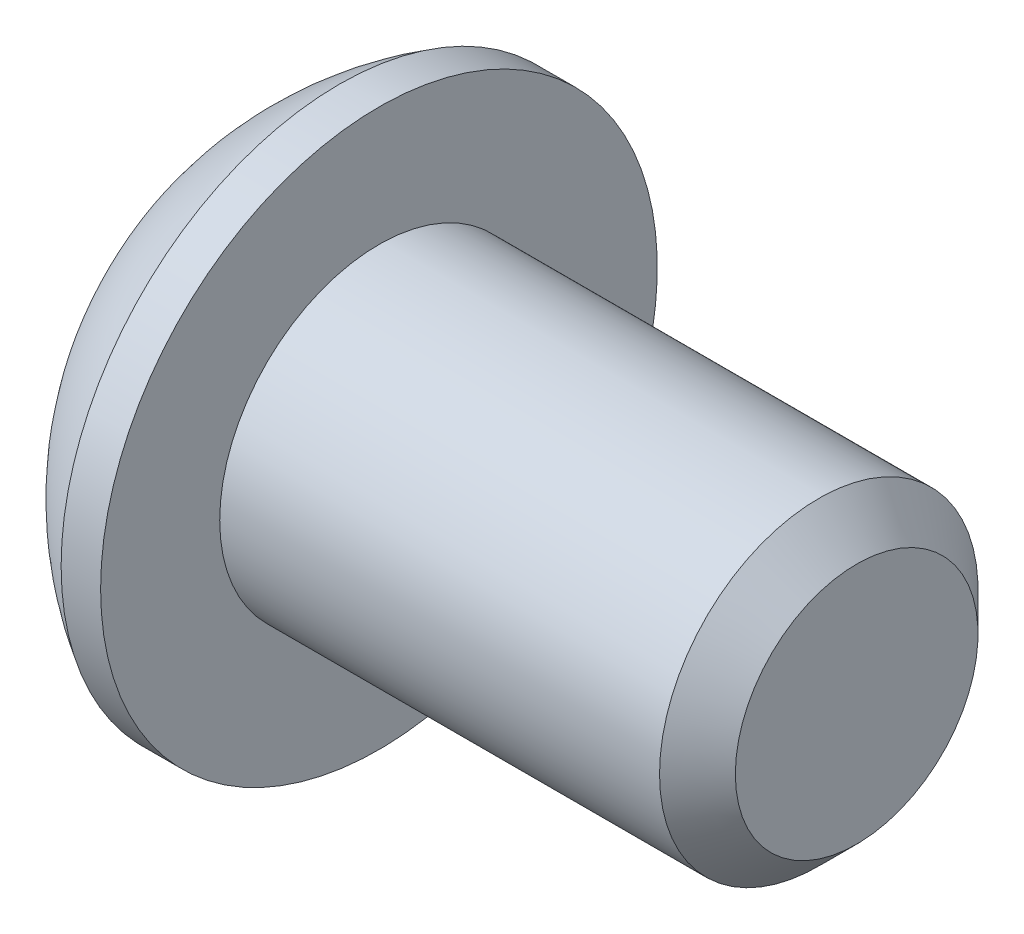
from build123d import *

# Parameters (mm, degrees)
HEX_2_DEPTH = 2.2098


with BuildPart() as part:
    # BodySke → BaseBody (revolve)
    with BuildSketch(Plane.XY, mode=Mode.PRIVATE) as basebody_sk:
        with BuildLine():
            Line((12.8778, 0), (12.8778, 2.41935))
            Line((12.8778, 2.41935), (12.12215, 3.175))
            Line((12.12215, 3.175), (3.3528, 3.175))
            Line((3.3528, 3.175), (3.3528, 5.5499))
            Line((3.3528, 5.5499), (2.5654, 5.5499))
            ThreePointArc((2.5654, 5.5499), (1.073764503, 4.355582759), (0, 2.77495))
            Line((0, 2.77495), (0, 0))
            Line((0, 0), (12.8778, 0))
        make_face()
    revolve(basebody_sk.sketch.rotate(Axis((0, 0, 0), (1, 0, 0)), 90), axis=Axis((0, 0, 0), (1, 0, 0)))

    # Sketch2 → PreBroach (revolve, cut)
    with BuildSketch(Plane.XY, mode=Mode.PRIVATE) as prebroach_sk:
        Polygon((0, 1.9812), (2.2098, 1.9812), (3.353646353, 0), (0, 0), align=None)
    revolve(prebroach_sk.sketch.rotate(Axis((0, 0, 0), (1, 0, 0)), 90), axis=Axis((0, 0, 0), (1, 0, 0)), mode=Mode.SUBTRACT)

    # Sketch3 → Hex 2 (cut)
    with BuildSketch(Plane(origin=(0, 0, 0), x_dir=(0, 0, -1), z_dir=(1, 0, 0))):
        Polygon((-1.9812, -1.143846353), (-1.9812, 1.143846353), (0, 2.287692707), (1.9812, 1.143846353), (1.9812, -1.143846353), (0, -2.287692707), align=None)
    extrude(amount=HEX_2_DEPTH, mode=Mode.SUBTRACT)


solid = part.part
